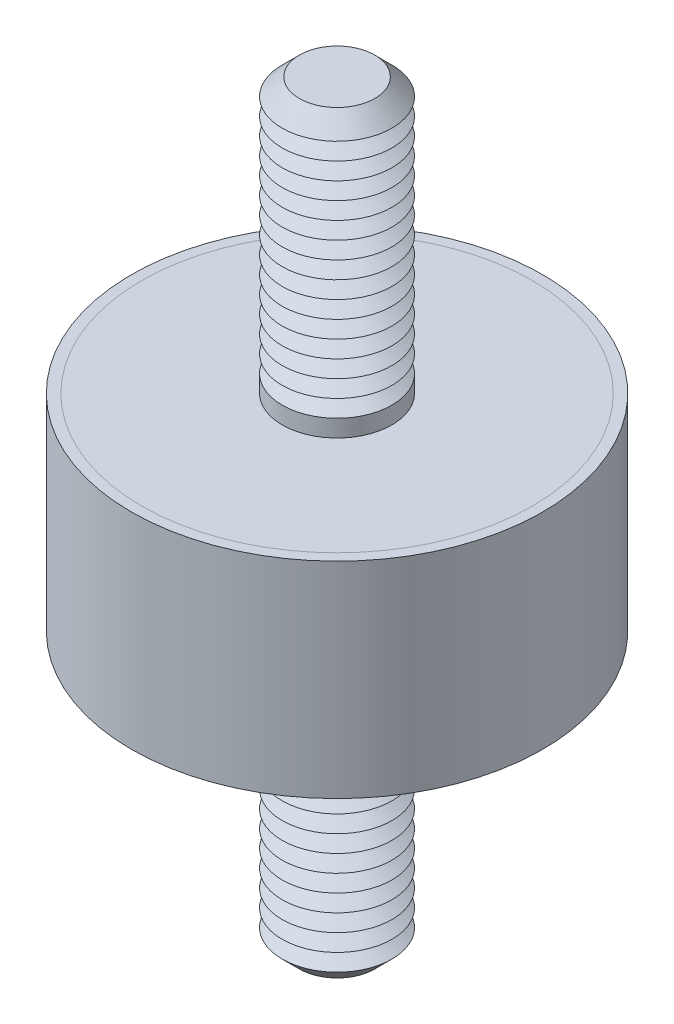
ISO-10303-21;
HEADER;
FILE_DESCRIPTION(('STEP AP214'),'2;1');
FILE_NAME('part.step','',(''),(''),'','','');
FILE_SCHEMA(('AUTOMOTIVE_DESIGN { 1 0 10303 214 1 1 1 1 }'));
ENDSEC;
DATA;
#1=APPLICATION_CONTEXT('core data for automotive mechanical design processes');
#2=APPLICATION_PROTOCOL_DEFINITION('international standard','automotive_design',2000,#1);
#3=PRODUCT_CONTEXT('',#1,'mechanical');
#4=PRODUCT('Part','Part','',(#3));
#5=PRODUCT_RELATED_PRODUCT_CATEGORY('part','',(#4));
#6=PRODUCT_DEFINITION_FORMATION('','',#4);
#7=PRODUCT_DEFINITION_CONTEXT('part definition',#1,'design');
#8=PRODUCT_DEFINITION('design','',#6,#7);
#9=PRODUCT_DEFINITION_SHAPE('','',#8);
#10=(LENGTH_UNIT() NAMED_UNIT(*) SI_UNIT(.MILLI.,.METRE.));
#11=(NAMED_UNIT(*) PLANE_ANGLE_UNIT() SI_UNIT($,.RADIAN.));
#12=(NAMED_UNIT(*) SI_UNIT($,.STERADIAN.) SOLID_ANGLE_UNIT());
#13=UNCERTAINTY_MEASURE_WITH_UNIT(LENGTH_MEASURE(1.E-05),#10,'distance_accuracy_value','');
#14=(GEOMETRIC_REPRESENTATION_CONTEXT(3) GLOBAL_UNCERTAINTY_ASSIGNED_CONTEXT((#13)) GLOBAL_UNIT_ASSIGNED_CONTEXT((#10,
#11,#12)) REPRESENTATION_CONTEXT('',''));
#15=CARTESIAN_POINT('',(0.,0.,0.));
#16=DIRECTION('',(0.,0.,1.));
#17=DIRECTION('',(1.,0.,0.));
#18=AXIS2_PLACEMENT_3D('',#15,#16,#17);
#19=CARTESIAN_POINT('',(0.,-27.5,0.));
#20=DIRECTION('',(0.,1.,0.));
#21=DIRECTION('',(0.,0.,1.));
#22=AXIS2_PLACEMENT_3D('',#19,#20,#21);
#23=CYLINDRICAL_SURFACE('',#22,4.);
#24=CARTESIAN_POINT('',(0.,-7.5,0.));
#25=DIRECTION('',(0.,-1.,0.));
#26=DIRECTION('',(0.,0.,-1.));
#27=AXIS2_PLACEMENT_3D('',#24,#25,#26);
#28=CIRCLE('',#27,4.);
#29=CARTESIAN_POINT('',(0.,-7.5,-4.));
#30=VERTEX_POINT('',#29);
#31=EDGE_CURVE('P0_E21',#30,#30,#28,.T.);
#32=ORIENTED_EDGE('',*,*,#31,.T.);
#33=EDGE_LOOP('',(#32));
#34=FACE_BOUND('',#33,.T.);
#35=CARTESIAN_POINT('',(0.,-8.75,0.));
#36=DIRECTION('',(0.,1.,0.));
#37=DIRECTION('',(0.,0.,1.));
#38=AXIS2_PLACEMENT_3D('',#35,#36,#37);
#39=CIRCLE('',#38,4.);
#40=CARTESIAN_POINT('',(0.,-8.75,4.));
#41=VERTEX_POINT('',#40);
#42=EDGE_CURVE('P0_E33',#41,#41,#39,.T.);
#43=ORIENTED_EDGE('',*,*,#42,.T.);
#44=EDGE_LOOP('',(#43));
#45=FACE_BOUND('',#44,.T.);
#46=ADVANCED_FACE('P0_F14',(#34,#45),#23,.T.);
#47=CARTESIAN_POINT('',(0.,-7.5,0.));
#48=DIRECTION('',(0.,1.,0.));
#49=DIRECTION('',(0.,0.,1.));
#50=AXIS2_PLACEMENT_3D('',#47,#48,#49);
#51=CYLINDRICAL_SURFACE('',#50,14.25);
#52=CARTESIAN_POINT('',(0.,-7.5,0.));
#53=DIRECTION('',(0.,1.,0.));
#54=DIRECTION('',(0.,0.,1.));
#55=AXIS2_PLACEMENT_3D('',#52,#53,#54);
#56=CIRCLE('',#55,14.25);
#57=CARTESIAN_POINT('',(0.,-7.5,14.25));
#58=VERTEX_POINT('',#57);
#59=EDGE_CURVE('P0_E25',#58,#58,#56,.T.);
#60=ORIENTED_EDGE('',*,*,#59,.T.);
#61=EDGE_LOOP('',(#60));
#62=FACE_BOUND('',#61,.T.);
#63=CARTESIAN_POINT('',(0.,-7.,0.));
#64=DIRECTION('',(0.,1.,0.));
#65=DIRECTION('',(0.,0.,1.));
#66=AXIS2_PLACEMENT_3D('',#63,#64,#65);
#67=CIRCLE('',#66,14.25);
#68=CARTESIAN_POINT('',(0.,-7.,14.25));
#69=VERTEX_POINT('',#68);
#70=EDGE_CURVE('P0_E30',#69,#69,#67,.T.);
#71=ORIENTED_EDGE('',*,*,#70,.F.);
#72=EDGE_LOOP('',(#71));
#73=FACE_BOUND('',#72,.T.);
#74=ADVANCED_FACE('P0_F145',(#62,#73),#51,.T.);
#75=CARTESIAN_POINT('',(0.,-7.5,0.));
#76=DIRECTION('',(0.,1.,0.));
#77=DIRECTION('',(0.,0.,1.));
#78=AXIS2_PLACEMENT_3D('',#75,#76,#77);
#79=PLANE('',#78);
#80=ORIENTED_EDGE('',*,*,#31,.F.);
#81=EDGE_LOOP('',(#80));
#82=FACE_BOUND('',#81,.T.);
#83=ORIENTED_EDGE('',*,*,#59,.F.);
#84=EDGE_LOOP('',(#83));
#85=FACE_BOUND('',#84,.T.);
#86=ADVANCED_FACE('P0_F150',(#82,#85),#79,.F.);
#87=CARTESIAN_POINT('',(0.,-7.,0.));
#88=DIRECTION('',(0.,1.,0.));
#89=DIRECTION('',(0.,0.,1.));
#90=AXIS2_PLACEMENT_3D('',#87,#88,#89);
#91=PLANE('',#90);
#92=ORIENTED_EDGE('',*,*,#70,.T.);
#93=EDGE_LOOP('',(#92));
#94=FACE_BOUND('',#93,.T.);
#95=ADVANCED_FACE('P0_F156',(#94),#91,.T.);
#96=CARTESIAN_POINT('',(0.,-8.75,0.));
#97=DIRECTION('',(0.,1.,0.));
#98=DIRECTION('',(0.,0.,1.));
#99=AXIS2_PLACEMENT_3D('',#96,#97,#98);
#100=CONICAL_SURFACE('',#99,4.,1.0471975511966);
#101=CARTESIAN_POINT('',(0.,-9.37499999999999,0.));
#102=DIRECTION('',(0.,1.,0.));
#103=DIRECTION('',(0.,0.,1.));
#104=AXIS2_PLACEMENT_3D('',#101,#102,#103);
#105=CIRCLE('',#104,2.91746824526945);
#106=CARTESIAN_POINT('',(0.,-9.37499999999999,2.91746824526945));
#107=VERTEX_POINT('',#106);
#108=EDGE_CURVE('P0_E39',#107,#107,#105,.T.);
#109=ORIENTED_EDGE('',*,*,#108,.T.);
#110=EDGE_LOOP('',(#109));
#111=FACE_BOUND('',#110,.T.);
#112=ORIENTED_EDGE('',*,*,#42,.F.);
#113=EDGE_LOOP('',(#112));
#114=FACE_BOUND('',#113,.T.);
#115=ADVANCED_FACE('P0_F159',(#111,#114),#100,.T.);
#116=CARTESIAN_POINT('',(0.,-9.37499999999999,0.));
#117=DIRECTION('',(0.,-1.,0.));
#118=DIRECTION('',(0.,0.,-1.));
#119=AXIS2_PLACEMENT_3D('',#116,#117,#118);
#120=CONICAL_SURFACE('',#119,2.91746824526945,1.04719755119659);
#121=CARTESIAN_POINT('',(0.,-10.,0.));
#122=DIRECTION('',(0.,1.,0.));
#123=DIRECTION('',(0.,0.,1.));
#124=AXIS2_PLACEMENT_3D('',#121,#122,#123);
#125=CIRCLE('',#124,4.);
#126=CARTESIAN_POINT('',(0.,-10.,4.));
#127=VERTEX_POINT('',#126);
#128=EDGE_CURVE('P0_E43',#127,#127,#125,.T.);
#129=ORIENTED_EDGE('',*,*,#128,.T.);
#130=EDGE_LOOP('',(#129));
#131=FACE_BOUND('',#130,.T.);
#132=ORIENTED_EDGE('',*,*,#108,.F.);
#133=EDGE_LOOP('',(#132));
#134=FACE_BOUND('',#133,.T.);
#135=ADVANCED_FACE('P0_F163',(#131,#134),#120,.T.);
#136=CARTESIAN_POINT('',(0.,-10.,0.));
#137=DIRECTION('',(0.,1.,0.));
#138=DIRECTION('',(0.,0.,1.));
#139=AXIS2_PLACEMENT_3D('',#136,#137,#138);
#140=CONICAL_SURFACE('',#139,4.,1.0471975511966);
#141=CARTESIAN_POINT('',(0.,-10.625,0.));
#142=DIRECTION('',(0.,1.,0.));
#143=DIRECTION('',(0.,0.,1.));
#144=AXIS2_PLACEMENT_3D('',#141,#142,#143);
#145=CIRCLE('',#144,2.91746824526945);
#146=CARTESIAN_POINT('',(0.,-10.625,2.91746824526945));
#147=VERTEX_POINT('',#146);
#148=EDGE_CURVE('P0_E47',#147,#147,#145,.T.);
#149=ORIENTED_EDGE('',*,*,#148,.T.);
#150=EDGE_LOOP('',(#149));
#151=FACE_BOUND('',#150,.T.);
#152=ORIENTED_EDGE('',*,*,#128,.F.);
#153=EDGE_LOOP('',(#152));
#154=FACE_BOUND('',#153,.T.);
#155=ADVANCED_FACE('P0_F167',(#151,#154),#140,.T.);
#156=CARTESIAN_POINT('',(0.,-10.625,0.));
#157=DIRECTION('',(0.,-1.,0.));
#158=DIRECTION('',(0.,0.,-1.));
#159=AXIS2_PLACEMENT_3D('',#156,#157,#158);
#160=CONICAL_SURFACE('',#159,2.91746824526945,1.04719755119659);
#161=CARTESIAN_POINT('',(0.,-11.25,0.));
#162=DIRECTION('',(0.,1.,0.));
#163=DIRECTION('',(0.,0.,1.));
#164=AXIS2_PLACEMENT_3D('',#161,#162,#163);
#165=CIRCLE('',#164,4.);
#166=CARTESIAN_POINT('',(0.,-11.25,4.));
#167=VERTEX_POINT('',#166);
#168=EDGE_CURVE('P0_E52',#167,#167,#165,.T.);
#169=ORIENTED_EDGE('',*,*,#168,.T.);
#170=EDGE_LOOP('',(#169));
#171=FACE_BOUND('',#170,.T.);
#172=ORIENTED_EDGE('',*,*,#148,.F.);
#173=EDGE_LOOP('',(#172));
#174=FACE_BOUND('',#173,.T.);
#175=ADVANCED_FACE('P0_F174',(#171,#174),#160,.T.);
#176=CARTESIAN_POINT('',(0.,-11.25,0.));
#177=DIRECTION('',(0.,1.,0.));
#178=DIRECTION('',(0.,0.,1.));
#179=AXIS2_PLACEMENT_3D('',#176,#177,#178);
#180=CONICAL_SURFACE('',#179,4.,1.0471975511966);
#181=CARTESIAN_POINT('',(0.,-11.875,0.));
#182=DIRECTION('',(0.,1.,0.));
#183=DIRECTION('',(0.,0.,1.));
#184=AXIS2_PLACEMENT_3D('',#181,#182,#183);
#185=CIRCLE('',#184,2.91746824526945);
#186=CARTESIAN_POINT('',(0.,-11.875,2.91746824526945));
#187=VERTEX_POINT('',#186);
#188=EDGE_CURVE('P0_E55',#187,#187,#185,.T.);
#189=ORIENTED_EDGE('',*,*,#188,.T.);
#190=EDGE_LOOP('',(#189));
#191=FACE_BOUND('',#190,.T.);
#192=ORIENTED_EDGE('',*,*,#168,.F.);
#193=EDGE_LOOP('',(#192));
#194=FACE_BOUND('',#193,.T.);
#195=ADVANCED_FACE('P0_F178',(#191,#194),#180,.T.);
#196=CARTESIAN_POINT('',(0.,-11.875,0.));
#197=DIRECTION('',(0.,-1.,0.));
#198=DIRECTION('',(0.,0.,-1.));
#199=AXIS2_PLACEMENT_3D('',#196,#197,#198);
#200=CONICAL_SURFACE('',#199,2.91746824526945,1.04719755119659);
#201=CARTESIAN_POINT('',(0.,-12.5,0.));
#202=DIRECTION('',(0.,1.,0.));
#203=DIRECTION('',(0.,0.,1.));
#204=AXIS2_PLACEMENT_3D('',#201,#202,#203);
#205=CIRCLE('',#204,4.);
#206=CARTESIAN_POINT('',(0.,-12.5,4.));
#207=VERTEX_POINT('',#206);
#208=EDGE_CURVE('P0_E58',#207,#207,#205,.T.);
#209=ORIENTED_EDGE('',*,*,#208,.T.);
#210=EDGE_LOOP('',(#209));
#211=FACE_BOUND('',#210,.T.);
#212=ORIENTED_EDGE('',*,*,#188,.F.);
#213=EDGE_LOOP('',(#212));
#214=FACE_BOUND('',#213,.T.);
#215=ADVANCED_FACE('P0_F182',(#211,#214),#200,.T.);
#216=CARTESIAN_POINT('',(0.,-12.5,0.));
#217=DIRECTION('',(0.,1.,0.));
#218=DIRECTION('',(0.,0.,1.));
#219=AXIS2_PLACEMENT_3D('',#216,#217,#218);
#220=CONICAL_SURFACE('',#219,4.,1.0471975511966);
#221=CARTESIAN_POINT('',(0.,-13.125,0.));
#222=DIRECTION('',(0.,1.,0.));
#223=DIRECTION('',(0.,0.,1.));
#224=AXIS2_PLACEMENT_3D('',#221,#222,#223);
#225=CIRCLE('',#224,2.91746824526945);
#226=CARTESIAN_POINT('',(0.,-13.125,2.91746824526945));
#227=VERTEX_POINT('',#226);
#228=EDGE_CURVE('P0_E61',#227,#227,#225,.T.);
#229=ORIENTED_EDGE('',*,*,#228,.T.);
#230=EDGE_LOOP('',(#229));
#231=FACE_BOUND('',#230,.T.);
#232=ORIENTED_EDGE('',*,*,#208,.F.);
#233=EDGE_LOOP('',(#232));
#234=FACE_BOUND('',#233,.T.);
#235=ADVANCED_FACE('P0_F186',(#231,#234),#220,.T.);
#236=CARTESIAN_POINT('',(0.,-13.125,0.));
#237=DIRECTION('',(0.,-1.,0.));
#238=DIRECTION('',(0.,0.,-1.));
#239=AXIS2_PLACEMENT_3D('',#236,#237,#238);
#240=CONICAL_SURFACE('',#239,2.91746824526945,1.04719755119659);
#241=CARTESIAN_POINT('',(0.,-13.75,0.));
#242=DIRECTION('',(0.,1.,0.));
#243=DIRECTION('',(0.,0.,1.));
#244=AXIS2_PLACEMENT_3D('',#241,#242,#243);
#245=CIRCLE('',#244,4.);
#246=CARTESIAN_POINT('',(0.,-13.75,4.));
#247=VERTEX_POINT('',#246);
#248=EDGE_CURVE('P0_E64',#247,#247,#245,.T.);
#249=ORIENTED_EDGE('',*,*,#248,.T.);
#250=EDGE_LOOP('',(#249));
#251=FACE_BOUND('',#250,.T.);
#252=ORIENTED_EDGE('',*,*,#228,.F.);
#253=EDGE_LOOP('',(#252));
#254=FACE_BOUND('',#253,.T.);
#255=ADVANCED_FACE('P0_F190',(#251,#254),#240,.T.);
#256=CARTESIAN_POINT('',(0.,-13.75,0.));
#257=DIRECTION('',(0.,1.,0.));
#258=DIRECTION('',(0.,0.,1.));
#259=AXIS2_PLACEMENT_3D('',#256,#257,#258);
#260=CONICAL_SURFACE('',#259,4.,1.0471975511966);
#261=CARTESIAN_POINT('',(0.,-14.375,0.));
#262=DIRECTION('',(0.,1.,0.));
#263=DIRECTION('',(0.,0.,1.));
#264=AXIS2_PLACEMENT_3D('',#261,#262,#263);
#265=CIRCLE('',#264,2.91746824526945);
#266=CARTESIAN_POINT('',(0.,-14.375,2.91746824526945));
#267=VERTEX_POINT('',#266);
#268=EDGE_CURVE('P0_E67',#267,#267,#265,.T.);
#269=ORIENTED_EDGE('',*,*,#268,.T.);
#270=EDGE_LOOP('',(#269));
#271=FACE_BOUND('',#270,.T.);
#272=ORIENTED_EDGE('',*,*,#248,.F.);
#273=EDGE_LOOP('',(#272));
#274=FACE_BOUND('',#273,.T.);
#275=ADVANCED_FACE('P0_F194',(#271,#274),#260,.T.);
#276=CARTESIAN_POINT('',(0.,-14.375,0.));
#277=DIRECTION('',(0.,-1.,0.));
#278=DIRECTION('',(0.,0.,-1.));
#279=AXIS2_PLACEMENT_3D('',#276,#277,#278);
#280=CONICAL_SURFACE('',#279,2.91746824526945,1.04719755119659);
#281=CARTESIAN_POINT('',(0.,-15.,0.));
#282=DIRECTION('',(0.,1.,0.));
#283=DIRECTION('',(0.,0.,1.));
#284=AXIS2_PLACEMENT_3D('',#281,#282,#283);
#285=CIRCLE('',#284,4.);
#286=CARTESIAN_POINT('',(0.,-15.,4.));
#287=VERTEX_POINT('',#286);
#288=EDGE_CURVE('P0_E70',#287,#287,#285,.T.);
#289=ORIENTED_EDGE('',*,*,#288,.T.);
#290=EDGE_LOOP('',(#289));
#291=FACE_BOUND('',#290,.T.);
#292=ORIENTED_EDGE('',*,*,#268,.F.);
#293=EDGE_LOOP('',(#292));
#294=FACE_BOUND('',#293,.T.);
#295=ADVANCED_FACE('P0_F198',(#291,#294),#280,.T.);
#296=CARTESIAN_POINT('',(0.,-15.,0.));
#297=DIRECTION('',(0.,1.,0.));
#298=DIRECTION('',(0.,0.,1.));
#299=AXIS2_PLACEMENT_3D('',#296,#297,#298);
#300=CONICAL_SURFACE('',#299,4.,1.0471975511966);
#301=CARTESIAN_POINT('',(0.,-15.625,0.));
#302=DIRECTION('',(0.,1.,0.));
#303=DIRECTION('',(0.,0.,1.));
#304=AXIS2_PLACEMENT_3D('',#301,#302,#303);
#305=CIRCLE('',#304,2.91746824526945);
#306=CARTESIAN_POINT('',(0.,-15.625,2.91746824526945));
#307=VERTEX_POINT('',#306);
#308=EDGE_CURVE('P0_E73',#307,#307,#305,.T.);
#309=ORIENTED_EDGE('',*,*,#308,.T.);
#310=EDGE_LOOP('',(#309));
#311=FACE_BOUND('',#310,.T.);
#312=ORIENTED_EDGE('',*,*,#288,.F.);
#313=EDGE_LOOP('',(#312));
#314=FACE_BOUND('',#313,.T.);
#315=ADVANCED_FACE('P0_F202',(#311,#314),#300,.T.);
#316=CARTESIAN_POINT('',(0.,-15.625,0.));
#317=DIRECTION('',(0.,-1.,0.));
#318=DIRECTION('',(0.,0.,-1.));
#319=AXIS2_PLACEMENT_3D('',#316,#317,#318);
#320=CONICAL_SURFACE('',#319,2.91746824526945,1.04719755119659);
#321=CARTESIAN_POINT('',(0.,-16.25,0.));
#322=DIRECTION('',(0.,1.,0.));
#323=DIRECTION('',(0.,0.,1.));
#324=AXIS2_PLACEMENT_3D('',#321,#322,#323);
#325=CIRCLE('',#324,4.);
#326=CARTESIAN_POINT('',(0.,-16.25,4.));
#327=VERTEX_POINT('',#326);
#328=EDGE_CURVE('P0_E76',#327,#327,#325,.T.);
#329=ORIENTED_EDGE('',*,*,#328,.T.);
#330=EDGE_LOOP('',(#329));
#331=FACE_BOUND('',#330,.T.);
#332=ORIENTED_EDGE('',*,*,#308,.F.);
#333=EDGE_LOOP('',(#332));
#334=FACE_BOUND('',#333,.T.);
#335=ADVANCED_FACE('P0_F206',(#331,#334),#320,.T.);
#336=CARTESIAN_POINT('',(0.,-16.25,0.));
#337=DIRECTION('',(0.,1.,0.));
#338=DIRECTION('',(0.,0.,1.));
#339=AXIS2_PLACEMENT_3D('',#336,#337,#338);
#340=CONICAL_SURFACE('',#339,4.,1.0471975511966);
#341=CARTESIAN_POINT('',(0.,-16.875,0.));
#342=DIRECTION('',(0.,1.,0.));
#343=DIRECTION('',(0.,0.,1.));
#344=AXIS2_PLACEMENT_3D('',#341,#342,#343);
#345=CIRCLE('',#344,2.91746824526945);
#346=CARTESIAN_POINT('',(0.,-16.875,2.91746824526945));
#347=VERTEX_POINT('',#346);
#348=EDGE_CURVE('P0_E79',#347,#347,#345,.T.);
#349=ORIENTED_EDGE('',*,*,#348,.T.);
#350=EDGE_LOOP('',(#349));
#351=FACE_BOUND('',#350,.T.);
#352=ORIENTED_EDGE('',*,*,#328,.F.);
#353=EDGE_LOOP('',(#352));
#354=FACE_BOUND('',#353,.T.);
#355=ADVANCED_FACE('P0_F210',(#351,#354),#340,.T.);
#356=CARTESIAN_POINT('',(0.,-16.875,0.));
#357=DIRECTION('',(0.,-1.,0.));
#358=DIRECTION('',(0.,0.,-1.));
#359=AXIS2_PLACEMENT_3D('',#356,#357,#358);
#360=CONICAL_SURFACE('',#359,2.91746824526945,1.04719755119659);
#361=CARTESIAN_POINT('',(0.,-17.5,0.));
#362=DIRECTION('',(0.,1.,0.));
#363=DIRECTION('',(0.,0.,1.));
#364=AXIS2_PLACEMENT_3D('',#361,#362,#363);
#365=CIRCLE('',#364,4.);
#366=CARTESIAN_POINT('',(0.,-17.5,4.));
#367=VERTEX_POINT('',#366);
#368=EDGE_CURVE('P0_E82',#367,#367,#365,.T.);
#369=ORIENTED_EDGE('',*,*,#368,.T.);
#370=EDGE_LOOP('',(#369));
#371=FACE_BOUND('',#370,.T.);
#372=ORIENTED_EDGE('',*,*,#348,.F.);
#373=EDGE_LOOP('',(#372));
#374=FACE_BOUND('',#373,.T.);
#375=ADVANCED_FACE('P0_F214',(#371,#374),#360,.T.);
#376=CARTESIAN_POINT('',(0.,-17.5,0.));
#377=DIRECTION('',(0.,1.,0.));
#378=DIRECTION('',(0.,0.,1.));
#379=AXIS2_PLACEMENT_3D('',#376,#377,#378);
#380=CONICAL_SURFACE('',#379,4.,1.0471975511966);
#381=CARTESIAN_POINT('',(0.,-18.125,0.));
#382=DIRECTION('',(0.,1.,0.));
#383=DIRECTION('',(0.,0.,1.));
#384=AXIS2_PLACEMENT_3D('',#381,#382,#383);
#385=CIRCLE('',#384,2.91746824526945);
#386=CARTESIAN_POINT('',(0.,-18.125,2.91746824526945));
#387=VERTEX_POINT('',#386);
#388=EDGE_CURVE('P0_E85',#387,#387,#385,.T.);
#389=ORIENTED_EDGE('',*,*,#388,.T.);
#390=EDGE_LOOP('',(#389));
#391=FACE_BOUND('',#390,.T.);
#392=ORIENTED_EDGE('',*,*,#368,.F.);
#393=EDGE_LOOP('',(#392));
#394=FACE_BOUND('',#393,.T.);
#395=ADVANCED_FACE('P0_F218',(#391,#394),#380,.T.);
#396=CARTESIAN_POINT('',(0.,-18.125,0.));
#397=DIRECTION('',(0.,-1.,0.));
#398=DIRECTION('',(0.,0.,-1.));
#399=AXIS2_PLACEMENT_3D('',#396,#397,#398);
#400=CONICAL_SURFACE('',#399,2.91746824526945,1.04719755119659);
#401=CARTESIAN_POINT('',(0.,-18.75,0.));
#402=DIRECTION('',(0.,1.,0.));
#403=DIRECTION('',(0.,0.,1.));
#404=AXIS2_PLACEMENT_3D('',#401,#402,#403);
#405=CIRCLE('',#404,4.);
#406=CARTESIAN_POINT('',(0.,-18.75,4.));
#407=VERTEX_POINT('',#406);
#408=EDGE_CURVE('P0_E88',#407,#407,#405,.T.);
#409=ORIENTED_EDGE('',*,*,#408,.T.);
#410=EDGE_LOOP('',(#409));
#411=FACE_BOUND('',#410,.T.);
#412=ORIENTED_EDGE('',*,*,#388,.F.);
#413=EDGE_LOOP('',(#412));
#414=FACE_BOUND('',#413,.T.);
#415=ADVANCED_FACE('P0_F222',(#411,#414),#400,.T.);
#416=CARTESIAN_POINT('',(0.,-18.75,0.));
#417=DIRECTION('',(0.,1.,0.));
#418=DIRECTION('',(0.,0.,1.));
#419=AXIS2_PLACEMENT_3D('',#416,#417,#418);
#420=CONICAL_SURFACE('',#419,4.,1.0471975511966);
#421=CARTESIAN_POINT('',(0.,-19.375,0.));
#422=DIRECTION('',(0.,1.,0.));
#423=DIRECTION('',(0.,0.,1.));
#424=AXIS2_PLACEMENT_3D('',#421,#422,#423);
#425=CIRCLE('',#424,2.91746824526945);
#426=CARTESIAN_POINT('',(0.,-19.375,2.91746824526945));
#427=VERTEX_POINT('',#426);
#428=EDGE_CURVE('P0_E91',#427,#427,#425,.T.);
#429=ORIENTED_EDGE('',*,*,#428,.T.);
#430=EDGE_LOOP('',(#429));
#431=FACE_BOUND('',#430,.T.);
#432=ORIENTED_EDGE('',*,*,#408,.F.);
#433=EDGE_LOOP('',(#432));
#434=FACE_BOUND('',#433,.T.);
#435=ADVANCED_FACE('P0_F226',(#431,#434),#420,.T.);
#436=CARTESIAN_POINT('',(0.,-19.375,0.));
#437=DIRECTION('',(0.,-1.,0.));
#438=DIRECTION('',(0.,0.,-1.));
#439=AXIS2_PLACEMENT_3D('',#436,#437,#438);
#440=CONICAL_SURFACE('',#439,2.91746824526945,1.04719755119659);
#441=CARTESIAN_POINT('',(0.,-20.,0.));
#442=DIRECTION('',(0.,1.,0.));
#443=DIRECTION('',(0.,0.,1.));
#444=AXIS2_PLACEMENT_3D('',#441,#442,#443);
#445=CIRCLE('',#444,4.);
#446=CARTESIAN_POINT('',(0.,-20.,4.));
#447=VERTEX_POINT('',#446);
#448=EDGE_CURVE('P0_E94',#447,#447,#445,.T.);
#449=ORIENTED_EDGE('',*,*,#448,.T.);
#450=EDGE_LOOP('',(#449));
#451=FACE_BOUND('',#450,.T.);
#452=ORIENTED_EDGE('',*,*,#428,.F.);
#453=EDGE_LOOP('',(#452));
#454=FACE_BOUND('',#453,.T.);
#455=ADVANCED_FACE('P0_F230',(#451,#454),#440,.T.);
#456=CARTESIAN_POINT('',(0.,-20.,0.));
#457=DIRECTION('',(0.,1.,0.));
#458=DIRECTION('',(0.,0.,1.));
#459=AXIS2_PLACEMENT_3D('',#456,#457,#458);
#460=CONICAL_SURFACE('',#459,4.,1.0471975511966);
#461=CARTESIAN_POINT('',(0.,-20.625,0.));
#462=DIRECTION('',(0.,1.,0.));
#463=DIRECTION('',(0.,0.,1.));
#464=AXIS2_PLACEMENT_3D('',#461,#462,#463);
#465=CIRCLE('',#464,2.91746824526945);
#466=CARTESIAN_POINT('',(0.,-20.625,2.91746824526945));
#467=VERTEX_POINT('',#466);
#468=EDGE_CURVE('P0_E97',#467,#467,#465,.T.);
#469=ORIENTED_EDGE('',*,*,#468,.T.);
#470=EDGE_LOOP('',(#469));
#471=FACE_BOUND('',#470,.T.);
#472=ORIENTED_EDGE('',*,*,#448,.F.);
#473=EDGE_LOOP('',(#472));
#474=FACE_BOUND('',#473,.T.);
#475=ADVANCED_FACE('P0_F234',(#471,#474),#460,.T.);
#476=CARTESIAN_POINT('',(0.,-20.625,0.));
#477=DIRECTION('',(0.,-1.,0.));
#478=DIRECTION('',(0.,0.,-1.));
#479=AXIS2_PLACEMENT_3D('',#476,#477,#478);
#480=CONICAL_SURFACE('',#479,2.91746824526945,1.04719755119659);
#481=CARTESIAN_POINT('',(0.,-21.25,0.));
#482=DIRECTION('',(0.,1.,0.));
#483=DIRECTION('',(0.,0.,1.));
#484=AXIS2_PLACEMENT_3D('',#481,#482,#483);
#485=CIRCLE('',#484,4.);
#486=CARTESIAN_POINT('',(0.,-21.25,4.));
#487=VERTEX_POINT('',#486);
#488=EDGE_CURVE('P0_E100',#487,#487,#485,.T.);
#489=ORIENTED_EDGE('',*,*,#488,.T.);
#490=EDGE_LOOP('',(#489));
#491=FACE_BOUND('',#490,.T.);
#492=ORIENTED_EDGE('',*,*,#468,.F.);
#493=EDGE_LOOP('',(#492));
#494=FACE_BOUND('',#493,.T.);
#495=ADVANCED_FACE('P0_F238',(#491,#494),#480,.T.);
#496=CARTESIAN_POINT('',(0.,-21.25,0.));
#497=DIRECTION('',(0.,1.,0.));
#498=DIRECTION('',(0.,0.,1.));
#499=AXIS2_PLACEMENT_3D('',#496,#497,#498);
#500=CONICAL_SURFACE('',#499,4.,1.0471975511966);
#501=CARTESIAN_POINT('',(0.,-21.875,0.));
#502=DIRECTION('',(0.,1.,0.));
#503=DIRECTION('',(0.,0.,1.));
#504=AXIS2_PLACEMENT_3D('',#501,#502,#503);
#505=CIRCLE('',#504,2.91746824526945);
#506=CARTESIAN_POINT('',(0.,-21.875,2.91746824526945));
#507=VERTEX_POINT('',#506);
#508=EDGE_CURVE('P0_E103',#507,#507,#505,.T.);
#509=ORIENTED_EDGE('',*,*,#508,.T.);
#510=EDGE_LOOP('',(#509));
#511=FACE_BOUND('',#510,.T.);
#512=ORIENTED_EDGE('',*,*,#488,.F.);
#513=EDGE_LOOP('',(#512));
#514=FACE_BOUND('',#513,.T.);
#515=ADVANCED_FACE('P0_F242',(#511,#514),#500,.T.);
#516=CARTESIAN_POINT('',(0.,-21.875,0.));
#517=DIRECTION('',(0.,-1.,0.));
#518=DIRECTION('',(0.,0.,-1.));
#519=AXIS2_PLACEMENT_3D('',#516,#517,#518);
#520=CONICAL_SURFACE('',#519,2.91746824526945,1.04719755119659);
#521=CARTESIAN_POINT('',(0.,-22.5,0.));
#522=DIRECTION('',(0.,1.,0.));
#523=DIRECTION('',(0.,0.,1.));
#524=AXIS2_PLACEMENT_3D('',#521,#522,#523);
#525=CIRCLE('',#524,4.);
#526=CARTESIAN_POINT('',(0.,-22.5,4.));
#527=VERTEX_POINT('',#526);
#528=EDGE_CURVE('P0_E106',#527,#527,#525,.T.);
#529=ORIENTED_EDGE('',*,*,#528,.T.);
#530=EDGE_LOOP('',(#529));
#531=FACE_BOUND('',#530,.T.);
#532=ORIENTED_EDGE('',*,*,#508,.F.);
#533=EDGE_LOOP('',(#532));
#534=FACE_BOUND('',#533,.T.);
#535=ADVANCED_FACE('P0_F246',(#531,#534),#520,.T.);
#536=CARTESIAN_POINT('',(0.,-22.5,0.));
#537=DIRECTION('',(0.,1.,0.));
#538=DIRECTION('',(0.,0.,1.));
#539=AXIS2_PLACEMENT_3D('',#536,#537,#538);
#540=CONICAL_SURFACE('',#539,4.,1.0471975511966);
#541=CARTESIAN_POINT('',(0.,-23.125,0.));
#542=DIRECTION('',(0.,1.,0.));
#543=DIRECTION('',(0.,0.,1.));
#544=AXIS2_PLACEMENT_3D('',#541,#542,#543);
#545=CIRCLE('',#544,2.91746824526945);
#546=CARTESIAN_POINT('',(0.,-23.125,2.91746824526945));
#547=VERTEX_POINT('',#546);
#548=EDGE_CURVE('P0_E109',#547,#547,#545,.T.);
#549=ORIENTED_EDGE('',*,*,#548,.T.);
#550=EDGE_LOOP('',(#549));
#551=FACE_BOUND('',#550,.T.);
#552=ORIENTED_EDGE('',*,*,#528,.F.);
#553=EDGE_LOOP('',(#552));
#554=FACE_BOUND('',#553,.T.);
#555=ADVANCED_FACE('P0_F250',(#551,#554),#540,.T.);
#556=CARTESIAN_POINT('',(0.,-23.125,0.));
#557=DIRECTION('',(0.,-1.,0.));
#558=DIRECTION('',(0.,0.,-1.));
#559=AXIS2_PLACEMENT_3D('',#556,#557,#558);
#560=CONICAL_SURFACE('',#559,2.91746824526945,1.04719755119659);
#561=CARTESIAN_POINT('',(0.,-23.75,0.));
#562=DIRECTION('',(0.,1.,0.));
#563=DIRECTION('',(0.,0.,1.));
#564=AXIS2_PLACEMENT_3D('',#561,#562,#563);
#565=CIRCLE('',#564,4.);
#566=CARTESIAN_POINT('',(0.,-23.75,4.));
#567=VERTEX_POINT('',#566);
#568=EDGE_CURVE('P0_E112',#567,#567,#565,.T.);
#569=ORIENTED_EDGE('',*,*,#568,.T.);
#570=EDGE_LOOP('',(#569));
#571=FACE_BOUND('',#570,.T.);
#572=ORIENTED_EDGE('',*,*,#548,.F.);
#573=EDGE_LOOP('',(#572));
#574=FACE_BOUND('',#573,.T.);
#575=ADVANCED_FACE('P0_F254',(#571,#574),#560,.T.);
#576=CARTESIAN_POINT('',(0.,-23.75,0.));
#577=DIRECTION('',(0.,1.,0.));
#578=DIRECTION('',(0.,0.,1.));
#579=AXIS2_PLACEMENT_3D('',#576,#577,#578);
#580=CONICAL_SURFACE('',#579,4.,1.0471975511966);
#581=CARTESIAN_POINT('',(0.,-24.375,0.));
#582=DIRECTION('',(0.,1.,0.));
#583=DIRECTION('',(0.,0.,1.));
#584=AXIS2_PLACEMENT_3D('',#581,#582,#583);
#585=CIRCLE('',#584,2.91746824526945);
#586=CARTESIAN_POINT('',(0.,-24.375,2.91746824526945));
#587=VERTEX_POINT('',#586);
#588=EDGE_CURVE('P0_E115',#587,#587,#585,.T.);
#589=ORIENTED_EDGE('',*,*,#588,.T.);
#590=EDGE_LOOP('',(#589));
#591=FACE_BOUND('',#590,.T.);
#592=ORIENTED_EDGE('',*,*,#568,.F.);
#593=EDGE_LOOP('',(#592));
#594=FACE_BOUND('',#593,.T.);
#595=ADVANCED_FACE('P0_F258',(#591,#594),#580,.T.);
#596=CARTESIAN_POINT('',(0.,-24.375,0.));
#597=DIRECTION('',(0.,-1.,0.));
#598=DIRECTION('',(0.,0.,-1.));
#599=AXIS2_PLACEMENT_3D('',#596,#597,#598);
#600=CONICAL_SURFACE('',#599,2.91746824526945,1.04719755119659);
#601=CARTESIAN_POINT('',(0.,-25.,0.));
#602=DIRECTION('',(0.,1.,0.));
#603=DIRECTION('',(0.,0.,1.));
#604=AXIS2_PLACEMENT_3D('',#601,#602,#603);
#605=CIRCLE('',#604,4.);
#606=CARTESIAN_POINT('',(0.,-25.,4.));
#607=VERTEX_POINT('',#606);
#608=EDGE_CURVE('P0_E118',#607,#607,#605,.T.);
#609=ORIENTED_EDGE('',*,*,#608,.T.);
#610=EDGE_LOOP('',(#609));
#611=FACE_BOUND('',#610,.T.);
#612=ORIENTED_EDGE('',*,*,#588,.F.);
#613=EDGE_LOOP('',(#612));
#614=FACE_BOUND('',#613,.T.);
#615=ADVANCED_FACE('P0_F142',(#611,#614),#600,.T.);
#616=CARTESIAN_POINT('',(0.,-25.,0.));
#617=DIRECTION('',(0.,1.,0.));
#618=DIRECTION('',(0.,0.,1.));
#619=AXIS2_PLACEMENT_3D('',#616,#617,#618);
#620=CONICAL_SURFACE('',#619,4.,1.0471975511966);
#621=CARTESIAN_POINT('',(0.,-25.625,0.));
#622=DIRECTION('',(0.,1.,0.));
#623=DIRECTION('',(0.,0.,1.));
#624=AXIS2_PLACEMENT_3D('',#621,#622,#623);
#625=CIRCLE('',#624,2.91746824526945);
#626=CARTESIAN_POINT('',(0.,-25.625,2.91746824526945));
#627=VERTEX_POINT('',#626);
#628=EDGE_CURVE('P0_E124',#627,#627,#625,.T.);
#629=ORIENTED_EDGE('',*,*,#628,.T.);
#630=EDGE_LOOP('',(#629));
#631=FACE_BOUND('',#630,.T.);
#632=ORIENTED_EDGE('',*,*,#608,.F.);
#633=EDGE_LOOP('',(#632));
#634=FACE_BOUND('',#633,.T.);
#635=ADVANCED_FACE('P0_F128',(#631,#634),#620,.T.);
#636=CARTESIAN_POINT('',(0.,-25.625,0.));
#637=DIRECTION('',(0.,-1.,0.));
#638=DIRECTION('',(0.,0.,-1.));
#639=AXIS2_PLACEMENT_3D('',#636,#637,#638);
#640=CONICAL_SURFACE('',#639,2.91746824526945,1.04719755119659);
#641=CARTESIAN_POINT('',(0.,-26.25,0.));
#642=DIRECTION('',(0.,1.,0.));
#643=DIRECTION('',(0.,0.,1.));
#644=AXIS2_PLACEMENT_3D('',#641,#642,#643);
#645=CIRCLE('',#644,4.);
#646=CARTESIAN_POINT('',(0.,-26.25,4.));
#647=VERTEX_POINT('',#646);
#648=EDGE_CURVE('P0_E121',#647,#647,#645,.T.);
#649=ORIENTED_EDGE('',*,*,#648,.T.);
#650=EDGE_LOOP('',(#649));
#651=FACE_BOUND('',#650,.T.);
#652=ORIENTED_EDGE('',*,*,#628,.F.);
#653=EDGE_LOOP('',(#652));
#654=FACE_BOUND('',#653,.T.);
#655=ADVANCED_FACE('P0_F131',(#651,#654),#640,.T.);
#656=CARTESIAN_POINT('',(0.,-27.5,0.));
#657=DIRECTION('',(0.,-1.,0.));
#658=DIRECTION('',(0.,0.,-1.));
#659=AXIS2_PLACEMENT_3D('',#656,#657,#658);
#660=PLANE('',#659);
#661=CARTESIAN_POINT('',(0.,-27.5,0.));
#662=DIRECTION('',(0.,-1.,0.));
#663=DIRECTION('',(0.,0.,-1.));
#664=AXIS2_PLACEMENT_3D('',#661,#662,#663);
#665=CIRCLE('',#664,2.75);
#666=CARTESIAN_POINT('',(0.,-27.5,-2.75));
#667=VERTEX_POINT('',#666);
#668=EDGE_CURVE('P0_E10',#667,#667,#665,.T.);
#669=ORIENTED_EDGE('',*,*,#668,.T.);
#670=EDGE_LOOP('',(#669));
#671=FACE_BOUND('',#670,.T.);
#672=ADVANCED_FACE('P0_F133',(#671),#660,.T.);
#673=CARTESIAN_POINT('',(0.,-27.5,0.));
#674=DIRECTION('',(0.,1.,0.));
#675=DIRECTION('',(0.,0.,1.));
#676=AXIS2_PLACEMENT_3D('',#673,#674,#675);
#677=CONICAL_SURFACE('',#676,2.75,0.785398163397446);
#678=ORIENTED_EDGE('',*,*,#648,.F.);
#679=EDGE_LOOP('',(#678));
#680=FACE_BOUND('',#679,.T.);
#681=ORIENTED_EDGE('',*,*,#668,.F.);
#682=EDGE_LOOP('',(#681));
#683=FACE_BOUND('',#682,.T.);
#684=ADVANCED_FACE('P0_F16',(#680,#683),#677,.T.);
#685=CLOSED_SHELL('',(#46,#74,#86,#95,#115,#135,#155,#175,#195,#215,#235,#255,#275,#295,#315,
#335,#355,#375,#395,#415,#435,#455,#475,#495,#515,#535,#555,#575,#595,#615,#635,#655,#672,#684));
#686=MANIFOLD_SOLID_BREP('P0_B1',#685);
#687=CARTESIAN_POINT('',(0.,27.5,0.));
#688=DIRECTION('',(0.,-1.,0.));
#689=DIRECTION('',(0.,0.,-1.));
#690=AXIS2_PLACEMENT_3D('',#687,#688,#689);
#691=CYLINDRICAL_SURFACE('',#690,4.);
#692=CARTESIAN_POINT('',(0.,8.75,0.));
#693=DIRECTION('',(0.,1.,0.));
#694=DIRECTION('',(0.,0.,1.));
#695=AXIS2_PLACEMENT_3D('',#692,#693,#694);
#696=CIRCLE('',#695,4.);
#697=CARTESIAN_POINT('',(0.,8.75,4.));
#698=VERTEX_POINT('',#697);
#699=EDGE_CURVE('P1_E33',#698,#698,#696,.T.);
#700=ORIENTED_EDGE('',*,*,#699,.F.);
#701=EDGE_LOOP('',(#700));
#702=FACE_BOUND('',#701,.T.);
#703=CARTESIAN_POINT('',(0.,7.5,0.));
#704=DIRECTION('',(0.,1.,0.));
#705=DIRECTION('',(0.,0.,1.));
#706=AXIS2_PLACEMENT_3D('',#703,#704,#705);
#707=CIRCLE('',#706,4.);
#708=CARTESIAN_POINT('',(0.,7.5,4.));
#709=VERTEX_POINT('',#708);
#710=EDGE_CURVE('P1_E21',#709,#709,#707,.T.);
#711=ORIENTED_EDGE('',*,*,#710,.T.);
#712=EDGE_LOOP('',(#711));
#713=FACE_BOUND('',#712,.T.);
#714=ADVANCED_FACE('P1_F14',(#702,#713),#691,.T.);
#715=CARTESIAN_POINT('',(0.,7.5,0.));
#716=DIRECTION('',(0.,-1.,0.));
#717=DIRECTION('',(0.,0.,-1.));
#718=AXIS2_PLACEMENT_3D('',#715,#716,#717);
#719=CYLINDRICAL_SURFACE('',#718,14.25);
#720=CARTESIAN_POINT('',(0.,7.5,0.));
#721=DIRECTION('',(0.,1.,0.));
#722=DIRECTION('',(0.,0.,1.));
#723=AXIS2_PLACEMENT_3D('',#720,#721,#722);
#724=CIRCLE('',#723,14.25);
#725=CARTESIAN_POINT('',(0.,7.5,14.25));
#726=VERTEX_POINT('',#725);
#727=EDGE_CURVE('P1_E25',#726,#726,#724,.T.);
#728=ORIENTED_EDGE('',*,*,#727,.F.);
#729=EDGE_LOOP('',(#728));
#730=FACE_BOUND('',#729,.T.);
#731=CARTESIAN_POINT('',(0.,7.,0.));
#732=DIRECTION('',(0.,1.,0.));
#733=DIRECTION('',(0.,0.,1.));
#734=AXIS2_PLACEMENT_3D('',#731,#732,#733);
#735=CIRCLE('',#734,14.25);
#736=CARTESIAN_POINT('',(0.,7.,14.25));
#737=VERTEX_POINT('',#736);
#738=EDGE_CURVE('P1_E30',#737,#737,#735,.T.);
#739=ORIENTED_EDGE('',*,*,#738,.T.);
#740=EDGE_LOOP('',(#739));
#741=FACE_BOUND('',#740,.T.);
#742=ADVANCED_FACE('P1_F292',(#730,#741),#719,.T.);
#743=CARTESIAN_POINT('',(0.,7.5,0.));
#744=DIRECTION('',(0.,1.,0.));
#745=DIRECTION('',(0.,0.,1.));
#746=AXIS2_PLACEMENT_3D('',#743,#744,#745);
#747=PLANE('',#746);
#748=ORIENTED_EDGE('',*,*,#710,.F.);
#749=EDGE_LOOP('',(#748));
#750=FACE_BOUND('',#749,.T.);
#751=ORIENTED_EDGE('',*,*,#727,.T.);
#752=EDGE_LOOP('',(#751));
#753=FACE_BOUND('',#752,.T.);
#754=ADVANCED_FACE('P1_F298',(#750,#753),#747,.T.);
#755=CARTESIAN_POINT('',(0.,7.,0.));
#756=DIRECTION('',(0.,1.,0.));
#757=DIRECTION('',(0.,0.,1.));
#758=AXIS2_PLACEMENT_3D('',#755,#756,#757);
#759=PLANE('',#758);
#760=ORIENTED_EDGE('',*,*,#738,.F.);
#761=EDGE_LOOP('',(#760));
#762=FACE_BOUND('',#761,.T.);
#763=ADVANCED_FACE('P1_F288',(#762),#759,.F.);
#764=CARTESIAN_POINT('',(0.,8.75,0.));
#765=DIRECTION('',(0.,-1.,0.));
#766=DIRECTION('',(0.,0.,-1.));
#767=AXIS2_PLACEMENT_3D('',#764,#765,#766);
#768=CONICAL_SURFACE('',#767,4.,1.0471975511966);
#769=CARTESIAN_POINT('',(0.,9.375,0.));
#770=DIRECTION('',(0.,1.,0.));
#771=DIRECTION('',(0.,0.,1.));
#772=AXIS2_PLACEMENT_3D('',#769,#770,#771);
#773=CIRCLE('',#772,2.91746824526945);
#774=CARTESIAN_POINT('',(0.,9.375,2.91746824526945));
#775=VERTEX_POINT('',#774);
#776=EDGE_CURVE('P1_E39',#775,#775,#773,.T.);
#777=ORIENTED_EDGE('',*,*,#776,.F.);
#778=EDGE_LOOP('',(#777));
#779=FACE_BOUND('',#778,.T.);
#780=ORIENTED_EDGE('',*,*,#699,.T.);
#781=EDGE_LOOP('',(#780));
#782=FACE_BOUND('',#781,.T.);
#783=ADVANCED_FACE('P1_F282',(#779,#782),#768,.T.);
#784=CARTESIAN_POINT('',(0.,9.375,0.));
#785=DIRECTION('',(0.,1.,0.));
#786=DIRECTION('',(0.,0.,1.));
#787=AXIS2_PLACEMENT_3D('',#784,#785,#786);
#788=CONICAL_SURFACE('',#787,2.91746824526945,1.04719755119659);
#789=CARTESIAN_POINT('',(0.,10.,0.));
#790=DIRECTION('',(0.,1.,0.));
#791=DIRECTION('',(0.,0.,1.));
#792=AXIS2_PLACEMENT_3D('',#789,#790,#791);
#793=CIRCLE('',#792,4.);
#794=CARTESIAN_POINT('',(0.,10.,4.));
#795=VERTEX_POINT('',#794);
#796=EDGE_CURVE('P1_E43',#795,#795,#793,.T.);
#797=ORIENTED_EDGE('',*,*,#796,.F.);
#798=EDGE_LOOP('',(#797));
#799=FACE_BOUND('',#798,.T.);
#800=ORIENTED_EDGE('',*,*,#776,.T.);
#801=EDGE_LOOP('',(#800));
#802=FACE_BOUND('',#801,.T.);
#803=ADVANCED_FACE('P1_F277',(#799,#802),#788,.T.);
#804=CARTESIAN_POINT('',(0.,10.,0.));
#805=DIRECTION('',(0.,-1.,0.));
#806=DIRECTION('',(0.,0.,-1.));
#807=AXIS2_PLACEMENT_3D('',#804,#805,#806);
#808=CONICAL_SURFACE('',#807,4.,1.0471975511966);
#809=CARTESIAN_POINT('',(0.,10.625,0.));
#810=DIRECTION('',(0.,1.,0.));
#811=DIRECTION('',(0.,0.,1.));
#812=AXIS2_PLACEMENT_3D('',#809,#810,#811);
#813=CIRCLE('',#812,2.91746824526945);
#814=CARTESIAN_POINT('',(0.,10.625,2.91746824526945));
#815=VERTEX_POINT('',#814);
#816=EDGE_CURVE('P1_E47',#815,#815,#813,.T.);
#817=ORIENTED_EDGE('',*,*,#816,.F.);
#818=EDGE_LOOP('',(#817));
#819=FACE_BOUND('',#818,.T.);
#820=ORIENTED_EDGE('',*,*,#796,.T.);
#821=EDGE_LOOP('',(#820));
#822=FACE_BOUND('',#821,.T.);
#823=ADVANCED_FACE('P1_F271',(#819,#822),#808,.T.);
#824=CARTESIAN_POINT('',(0.,10.625,0.));
#825=DIRECTION('',(0.,1.,0.));
#826=DIRECTION('',(0.,0.,1.));
#827=AXIS2_PLACEMENT_3D('',#824,#825,#826);
#828=CONICAL_SURFACE('',#827,2.91746824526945,1.04719755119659);
#829=CARTESIAN_POINT('',(0.,11.25,0.));
#830=DIRECTION('',(0.,1.,0.));
#831=DIRECTION('',(0.,0.,1.));
#832=AXIS2_PLACEMENT_3D('',#829,#830,#831);
#833=CIRCLE('',#832,4.);
#834=CARTESIAN_POINT('',(0.,11.25,4.));
#835=VERTEX_POINT('',#834);
#836=EDGE_CURVE('P1_E52',#835,#835,#833,.T.);
#837=ORIENTED_EDGE('',*,*,#836,.F.);
#838=EDGE_LOOP('',(#837));
#839=FACE_BOUND('',#838,.T.);
#840=ORIENTED_EDGE('',*,*,#816,.T.);
#841=EDGE_LOOP('',(#840));
#842=FACE_BOUND('',#841,.T.);
#843=ADVANCED_FACE('P1_F265',(#839,#842),#828,.T.);
#844=CARTESIAN_POINT('',(0.,11.25,0.));
#845=DIRECTION('',(0.,-1.,0.));
#846=DIRECTION('',(0.,0.,-1.));
#847=AXIS2_PLACEMENT_3D('',#844,#845,#846);
#848=CONICAL_SURFACE('',#847,4.,1.0471975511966);
#849=CARTESIAN_POINT('',(0.,11.875,0.));
#850=DIRECTION('',(0.,1.,0.));
#851=DIRECTION('',(0.,0.,1.));
#852=AXIS2_PLACEMENT_3D('',#849,#850,#851);
#853=CIRCLE('',#852,2.91746824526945);
#854=CARTESIAN_POINT('',(0.,11.875,2.91746824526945));
#855=VERTEX_POINT('',#854);
#856=EDGE_CURVE('P1_E55',#855,#855,#853,.T.);
#857=ORIENTED_EDGE('',*,*,#856,.F.);
#858=EDGE_LOOP('',(#857));
#859=FACE_BOUND('',#858,.T.);
#860=ORIENTED_EDGE('',*,*,#836,.T.);
#861=EDGE_LOOP('',(#860));
#862=FACE_BOUND('',#861,.T.);
#863=ADVANCED_FACE('P1_F259',(#859,#862),#848,.T.);
#864=CARTESIAN_POINT('',(0.,11.875,0.));
#865=DIRECTION('',(0.,1.,0.));
#866=DIRECTION('',(0.,0.,1.));
#867=AXIS2_PLACEMENT_3D('',#864,#865,#866);
#868=CONICAL_SURFACE('',#867,2.91746824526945,1.04719755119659);
#869=CARTESIAN_POINT('',(0.,12.5,0.));
#870=DIRECTION('',(0.,1.,0.));
#871=DIRECTION('',(0.,0.,1.));
#872=AXIS2_PLACEMENT_3D('',#869,#870,#871);
#873=CIRCLE('',#872,4.);
#874=CARTESIAN_POINT('',(0.,12.5,4.));
#875=VERTEX_POINT('',#874);
#876=EDGE_CURVE('P1_E58',#875,#875,#873,.T.);
#877=ORIENTED_EDGE('',*,*,#876,.F.);
#878=EDGE_LOOP('',(#877));
#879=FACE_BOUND('',#878,.T.);
#880=ORIENTED_EDGE('',*,*,#856,.T.);
#881=EDGE_LOOP('',(#880));
#882=FACE_BOUND('',#881,.T.);
#883=ADVANCED_FACE('P1_F253',(#879,#882),#868,.T.);
#884=CARTESIAN_POINT('',(0.,12.5,0.));
#885=DIRECTION('',(0.,-1.,0.));
#886=DIRECTION('',(0.,0.,-1.));
#887=AXIS2_PLACEMENT_3D('',#884,#885,#886);
#888=CONICAL_SURFACE('',#887,4.,1.0471975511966);
#889=CARTESIAN_POINT('',(0.,13.125,0.));
#890=DIRECTION('',(0.,1.,0.));
#891=DIRECTION('',(0.,0.,1.));
#892=AXIS2_PLACEMENT_3D('',#889,#890,#891);
#893=CIRCLE('',#892,2.91746824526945);
#894=CARTESIAN_POINT('',(0.,13.125,2.91746824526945));
#895=VERTEX_POINT('',#894);
#896=EDGE_CURVE('P1_E61',#895,#895,#893,.T.);
#897=ORIENTED_EDGE('',*,*,#896,.F.);
#898=EDGE_LOOP('',(#897));
#899=FACE_BOUND('',#898,.T.);
#900=ORIENTED_EDGE('',*,*,#876,.T.);
#901=EDGE_LOOP('',(#900));
#902=FACE_BOUND('',#901,.T.);
#903=ADVANCED_FACE('P1_F247',(#899,#902),#888,.T.);
#904=CARTESIAN_POINT('',(0.,13.125,0.));
#905=DIRECTION('',(0.,1.,0.));
#906=DIRECTION('',(0.,0.,1.));
#907=AXIS2_PLACEMENT_3D('',#904,#905,#906);
#908=CONICAL_SURFACE('',#907,2.91746824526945,1.04719755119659);
#909=CARTESIAN_POINT('',(0.,13.75,0.));
#910=DIRECTION('',(0.,1.,0.));
#911=DIRECTION('',(0.,0.,1.));
#912=AXIS2_PLACEMENT_3D('',#909,#910,#911);
#913=CIRCLE('',#912,4.);
#914=CARTESIAN_POINT('',(0.,13.75,4.));
#915=VERTEX_POINT('',#914);
#916=EDGE_CURVE('P1_E64',#915,#915,#913,.T.);
#917=ORIENTED_EDGE('',*,*,#916,.F.);
#918=EDGE_LOOP('',(#917));
#919=FACE_BOUND('',#918,.T.);
#920=ORIENTED_EDGE('',*,*,#896,.T.);
#921=EDGE_LOOP('',(#920));
#922=FACE_BOUND('',#921,.T.);
#923=ADVANCED_FACE('P1_F241',(#919,#922),#908,.T.);
#924=CARTESIAN_POINT('',(0.,13.75,0.));
#925=DIRECTION('',(0.,-1.,0.));
#926=DIRECTION('',(0.,0.,-1.));
#927=AXIS2_PLACEMENT_3D('',#924,#925,#926);
#928=CONICAL_SURFACE('',#927,4.,1.0471975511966);
#929=CARTESIAN_POINT('',(0.,14.375,0.));
#930=DIRECTION('',(0.,1.,0.));
#931=DIRECTION('',(0.,0.,1.));
#932=AXIS2_PLACEMENT_3D('',#929,#930,#931);
#933=CIRCLE('',#932,2.91746824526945);
#934=CARTESIAN_POINT('',(0.,14.375,2.91746824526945));
#935=VERTEX_POINT('',#934);
#936=EDGE_CURVE('P1_E67',#935,#935,#933,.T.);
#937=ORIENTED_EDGE('',*,*,#936,.F.);
#938=EDGE_LOOP('',(#937));
#939=FACE_BOUND('',#938,.T.);
#940=ORIENTED_EDGE('',*,*,#916,.T.);
#941=EDGE_LOOP('',(#940));
#942=FACE_BOUND('',#941,.T.);
#943=ADVANCED_FACE('P1_F235',(#939,#942),#928,.T.);
#944=CARTESIAN_POINT('',(0.,14.375,0.));
#945=DIRECTION('',(0.,1.,0.));
#946=DIRECTION('',(0.,0.,1.));
#947=AXIS2_PLACEMENT_3D('',#944,#945,#946);
#948=CONICAL_SURFACE('',#947,2.91746824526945,1.04719755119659);
#949=CARTESIAN_POINT('',(0.,15.,0.));
#950=DIRECTION('',(0.,1.,0.));
#951=DIRECTION('',(0.,0.,1.));
#952=AXIS2_PLACEMENT_3D('',#949,#950,#951);
#953=CIRCLE('',#952,4.);
#954=CARTESIAN_POINT('',(0.,15.,4.));
#955=VERTEX_POINT('',#954);
#956=EDGE_CURVE('P1_E70',#955,#955,#953,.T.);
#957=ORIENTED_EDGE('',*,*,#956,.F.);
#958=EDGE_LOOP('',(#957));
#959=FACE_BOUND('',#958,.T.);
#960=ORIENTED_EDGE('',*,*,#936,.T.);
#961=EDGE_LOOP('',(#960));
#962=FACE_BOUND('',#961,.T.);
#963=ADVANCED_FACE('P1_F229',(#959,#962),#948,.T.);
#964=CARTESIAN_POINT('',(0.,15.,0.));
#965=DIRECTION('',(0.,-1.,0.));
#966=DIRECTION('',(0.,0.,-1.));
#967=AXIS2_PLACEMENT_3D('',#964,#965,#966);
#968=CONICAL_SURFACE('',#967,4.,1.0471975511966);
#969=CARTESIAN_POINT('',(0.,15.625,0.));
#970=DIRECTION('',(0.,1.,0.));
#971=DIRECTION('',(0.,0.,1.));
#972=AXIS2_PLACEMENT_3D('',#969,#970,#971);
#973=CIRCLE('',#972,2.91746824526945);
#974=CARTESIAN_POINT('',(0.,15.625,2.91746824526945));
#975=VERTEX_POINT('',#974);
#976=EDGE_CURVE('P1_E73',#975,#975,#973,.T.);
#977=ORIENTED_EDGE('',*,*,#976,.F.);
#978=EDGE_LOOP('',(#977));
#979=FACE_BOUND('',#978,.T.);
#980=ORIENTED_EDGE('',*,*,#956,.T.);
#981=EDGE_LOOP('',(#980));
#982=FACE_BOUND('',#981,.T.);
#983=ADVANCED_FACE('P1_F223',(#979,#982),#968,.T.);
#984=CARTESIAN_POINT('',(0.,15.625,0.));
#985=DIRECTION('',(0.,1.,0.));
#986=DIRECTION('',(0.,0.,1.));
#987=AXIS2_PLACEMENT_3D('',#984,#985,#986);
#988=CONICAL_SURFACE('',#987,2.91746824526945,1.04719755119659);
#989=CARTESIAN_POINT('',(0.,16.25,0.));
#990=DIRECTION('',(0.,1.,0.));
#991=DIRECTION('',(0.,0.,1.));
#992=AXIS2_PLACEMENT_3D('',#989,#990,#991);
#993=CIRCLE('',#992,4.);
#994=CARTESIAN_POINT('',(0.,16.25,4.));
#995=VERTEX_POINT('',#994);
#996=EDGE_CURVE('P1_E76',#995,#995,#993,.T.);
#997=ORIENTED_EDGE('',*,*,#996,.F.);
#998=EDGE_LOOP('',(#997));
#999=FACE_BOUND('',#998,.T.);
#1000=ORIENTED_EDGE('',*,*,#976,.T.);
#1001=EDGE_LOOP('',(#1000));
#1002=FACE_BOUND('',#1001,.T.);
#1003=ADVANCED_FACE('P1_F217',(#999,#1002),#988,.T.);
#1004=CARTESIAN_POINT('',(0.,16.25,0.));
#1005=DIRECTION('',(0.,-1.,0.));
#1006=DIRECTION('',(0.,0.,-1.));
#1007=AXIS2_PLACEMENT_3D('',#1004,#1005,#1006);
#1008=CONICAL_SURFACE('',#1007,4.,1.0471975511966);
#1009=CARTESIAN_POINT('',(0.,16.875,0.));
#1010=DIRECTION('',(0.,1.,0.));
#1011=DIRECTION('',(0.,0.,1.));
#1012=AXIS2_PLACEMENT_3D('',#1009,#1010,#1011);
#1013=CIRCLE('',#1012,2.91746824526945);
#1014=CARTESIAN_POINT('',(0.,16.875,2.91746824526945));
#1015=VERTEX_POINT('',#1014);
#1016=EDGE_CURVE('P1_E79',#1015,#1015,#1013,.T.);
#1017=ORIENTED_EDGE('',*,*,#1016,.F.);
#1018=EDGE_LOOP('',(#1017));
#1019=FACE_BOUND('',#1018,.T.);
#1020=ORIENTED_EDGE('',*,*,#996,.T.);
#1021=EDGE_LOOP('',(#1020));
#1022=FACE_BOUND('',#1021,.T.);
#1023=ADVANCED_FACE('P1_F211',(#1019,#1022),#1008,.T.);
#1024=CARTESIAN_POINT('',(0.,16.875,0.));
#1025=DIRECTION('',(0.,1.,0.));
#1026=DIRECTION('',(0.,0.,1.));
#1027=AXIS2_PLACEMENT_3D('',#1024,#1025,#1026);
#1028=CONICAL_SURFACE('',#1027,2.91746824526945,1.04719755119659);
#1029=CARTESIAN_POINT('',(0.,17.5,0.));
#1030=DIRECTION('',(0.,1.,0.));
#1031=DIRECTION('',(0.,0.,1.));
#1032=AXIS2_PLACEMENT_3D('',#1029,#1030,#1031);
#1033=CIRCLE('',#1032,4.);
#1034=CARTESIAN_POINT('',(0.,17.5,4.));
#1035=VERTEX_POINT('',#1034);
#1036=EDGE_CURVE('P1_E82',#1035,#1035,#1033,.T.);
#1037=ORIENTED_EDGE('',*,*,#1036,.F.);
#1038=EDGE_LOOP('',(#1037));
#1039=FACE_BOUND('',#1038,.T.);
#1040=ORIENTED_EDGE('',*,*,#1016,.T.);
#1041=EDGE_LOOP('',(#1040));
#1042=FACE_BOUND('',#1041,.T.);
#1043=ADVANCED_FACE('P1_F205',(#1039,#1042),#1028,.T.);
#1044=CARTESIAN_POINT('',(0.,17.5,0.));
#1045=DIRECTION('',(0.,-1.,0.));
#1046=DIRECTION('',(0.,0.,-1.));
#1047=AXIS2_PLACEMENT_3D('',#1044,#1045,#1046);
#1048=CONICAL_SURFACE('',#1047,4.,1.0471975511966);
#1049=CARTESIAN_POINT('',(0.,18.125,0.));
#1050=DIRECTION('',(0.,1.,0.));
#1051=DIRECTION('',(0.,0.,1.));
#1052=AXIS2_PLACEMENT_3D('',#1049,#1050,#1051);
#1053=CIRCLE('',#1052,2.91746824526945);
#1054=CARTESIAN_POINT('',(0.,18.125,2.91746824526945));
#1055=VERTEX_POINT('',#1054);
#1056=EDGE_CURVE('P1_E85',#1055,#1055,#1053,.T.);
#1057=ORIENTED_EDGE('',*,*,#1056,.F.);
#1058=EDGE_LOOP('',(#1057));
#1059=FACE_BOUND('',#1058,.T.);
#1060=ORIENTED_EDGE('',*,*,#1036,.T.);
#1061=EDGE_LOOP('',(#1060));
#1062=FACE_BOUND('',#1061,.T.);
#1063=ADVANCED_FACE('P1_F199',(#1059,#1062),#1048,.T.);
#1064=CARTESIAN_POINT('',(0.,18.125,0.));
#1065=DIRECTION('',(0.,1.,0.));
#1066=DIRECTION('',(0.,0.,1.));
#1067=AXIS2_PLACEMENT_3D('',#1064,#1065,#1066);
#1068=CONICAL_SURFACE('',#1067,2.91746824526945,1.04719755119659);
#1069=CARTESIAN_POINT('',(0.,18.75,0.));
#1070=DIRECTION('',(0.,1.,0.));
#1071=DIRECTION('',(0.,0.,1.));
#1072=AXIS2_PLACEMENT_3D('',#1069,#1070,#1071);
#1073=CIRCLE('',#1072,4.);
#1074=CARTESIAN_POINT('',(0.,18.75,4.));
#1075=VERTEX_POINT('',#1074);
#1076=EDGE_CURVE('P1_E88',#1075,#1075,#1073,.T.);
#1077=ORIENTED_EDGE('',*,*,#1076,.F.);
#1078=EDGE_LOOP('',(#1077));
#1079=FACE_BOUND('',#1078,.T.);
#1080=ORIENTED_EDGE('',*,*,#1056,.T.);
#1081=EDGE_LOOP('',(#1080));
#1082=FACE_BOUND('',#1081,.T.);
#1083=ADVANCED_FACE('P1_F193',(#1079,#1082),#1068,.T.);
#1084=CARTESIAN_POINT('',(0.,18.75,0.));
#1085=DIRECTION('',(0.,-1.,0.));
#1086=DIRECTION('',(0.,0.,-1.));
#1087=AXIS2_PLACEMENT_3D('',#1084,#1085,#1086);
#1088=CONICAL_SURFACE('',#1087,4.,1.0471975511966);
#1089=CARTESIAN_POINT('',(0.,19.375,0.));
#1090=DIRECTION('',(0.,1.,0.));
#1091=DIRECTION('',(0.,0.,1.));
#1092=AXIS2_PLACEMENT_3D('',#1089,#1090,#1091);
#1093=CIRCLE('',#1092,2.91746824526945);
#1094=CARTESIAN_POINT('',(0.,19.375,2.91746824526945));
#1095=VERTEX_POINT('',#1094);
#1096=EDGE_CURVE('P1_E91',#1095,#1095,#1093,.T.);
#1097=ORIENTED_EDGE('',*,*,#1096,.F.);
#1098=EDGE_LOOP('',(#1097));
#1099=FACE_BOUND('',#1098,.T.);
#1100=ORIENTED_EDGE('',*,*,#1076,.T.);
#1101=EDGE_LOOP('',(#1100));
#1102=FACE_BOUND('',#1101,.T.);
#1103=ADVANCED_FACE('P1_F187',(#1099,#1102),#1088,.T.);
#1104=CARTESIAN_POINT('',(0.,19.375,0.));
#1105=DIRECTION('',(0.,1.,0.));
#1106=DIRECTION('',(0.,0.,1.));
#1107=AXIS2_PLACEMENT_3D('',#1104,#1105,#1106);
#1108=CONICAL_SURFACE('',#1107,2.91746824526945,1.04719755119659);
#1109=CARTESIAN_POINT('',(0.,20.,0.));
#1110=DIRECTION('',(0.,1.,0.));
#1111=DIRECTION('',(0.,0.,1.));
#1112=AXIS2_PLACEMENT_3D('',#1109,#1110,#1111);
#1113=CIRCLE('',#1112,4.);
#1114=CARTESIAN_POINT('',(0.,20.,4.));
#1115=VERTEX_POINT('',#1114);
#1116=EDGE_CURVE('P1_E94',#1115,#1115,#1113,.T.);
#1117=ORIENTED_EDGE('',*,*,#1116,.F.);
#1118=EDGE_LOOP('',(#1117));
#1119=FACE_BOUND('',#1118,.T.);
#1120=ORIENTED_EDGE('',*,*,#1096,.T.);
#1121=EDGE_LOOP('',(#1120));
#1122=FACE_BOUND('',#1121,.T.);
#1123=ADVANCED_FACE('P1_F181',(#1119,#1122),#1108,.T.);
#1124=CARTESIAN_POINT('',(0.,20.,0.));
#1125=DIRECTION('',(0.,-1.,0.));
#1126=DIRECTION('',(0.,0.,-1.));
#1127=AXIS2_PLACEMENT_3D('',#1124,#1125,#1126);
#1128=CONICAL_SURFACE('',#1127,4.,1.0471975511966);
#1129=CARTESIAN_POINT('',(0.,20.625,0.));
#1130=DIRECTION('',(0.,1.,0.));
#1131=DIRECTION('',(0.,0.,1.));
#1132=AXIS2_PLACEMENT_3D('',#1129,#1130,#1131);
#1133=CIRCLE('',#1132,2.91746824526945);
#1134=CARTESIAN_POINT('',(0.,20.625,2.91746824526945));
#1135=VERTEX_POINT('',#1134);
#1136=EDGE_CURVE('P1_E97',#1135,#1135,#1133,.T.);
#1137=ORIENTED_EDGE('',*,*,#1136,.F.);
#1138=EDGE_LOOP('',(#1137));
#1139=FACE_BOUND('',#1138,.T.);
#1140=ORIENTED_EDGE('',*,*,#1116,.T.);
#1141=EDGE_LOOP('',(#1140));
#1142=FACE_BOUND('',#1141,.T.);
#1143=ADVANCED_FACE('P1_F175',(#1139,#1142),#1128,.T.);
#1144=CARTESIAN_POINT('',(0.,20.625,0.));
#1145=DIRECTION('',(0.,1.,0.));
#1146=DIRECTION('',(0.,0.,1.));
#1147=AXIS2_PLACEMENT_3D('',#1144,#1145,#1146);
#1148=CONICAL_SURFACE('',#1147,2.91746824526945,1.04719755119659);
#1149=CARTESIAN_POINT('',(0.,21.25,0.));
#1150=DIRECTION('',(0.,1.,0.));
#1151=DIRECTION('',(0.,0.,1.));
#1152=AXIS2_PLACEMENT_3D('',#1149,#1150,#1151);
#1153=CIRCLE('',#1152,4.);
#1154=CARTESIAN_POINT('',(0.,21.25,4.));
#1155=VERTEX_POINT('',#1154);
#1156=EDGE_CURVE('P1_E100',#1155,#1155,#1153,.T.);
#1157=ORIENTED_EDGE('',*,*,#1156,.F.);
#1158=EDGE_LOOP('',(#1157));
#1159=FACE_BOUND('',#1158,.T.);
#1160=ORIENTED_EDGE('',*,*,#1136,.T.);
#1161=EDGE_LOOP('',(#1160));
#1162=FACE_BOUND('',#1161,.T.);
#1163=ADVANCED_FACE('P1_F169',(#1159,#1162),#1148,.T.);
#1164=CARTESIAN_POINT('',(0.,21.25,0.));
#1165=DIRECTION('',(0.,-1.,0.));
#1166=DIRECTION('',(0.,0.,-1.));
#1167=AXIS2_PLACEMENT_3D('',#1164,#1165,#1166);
#1168=CONICAL_SURFACE('',#1167,4.,1.0471975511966);
#1169=CARTESIAN_POINT('',(0.,21.875,0.));
#1170=DIRECTION('',(0.,1.,0.));
#1171=DIRECTION('',(0.,0.,1.));
#1172=AXIS2_PLACEMENT_3D('',#1169,#1170,#1171);
#1173=CIRCLE('',#1172,2.91746824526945);
#1174=CARTESIAN_POINT('',(0.,21.875,2.91746824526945));
#1175=VERTEX_POINT('',#1174);
#1176=EDGE_CURVE('P1_E103',#1175,#1175,#1173,.T.);
#1177=ORIENTED_EDGE('',*,*,#1176,.F.);
#1178=EDGE_LOOP('',(#1177));
#1179=FACE_BOUND('',#1178,.T.);
#1180=ORIENTED_EDGE('',*,*,#1156,.T.);
#1181=EDGE_LOOP('',(#1180));
#1182=FACE_BOUND('',#1181,.T.);
#1183=ADVANCED_FACE('P1_F163',(#1179,#1182),#1168,.T.);
#1184=CARTESIAN_POINT('',(0.,21.875,0.));
#1185=DIRECTION('',(0.,1.,0.));
#1186=DIRECTION('',(0.,0.,1.));
#1187=AXIS2_PLACEMENT_3D('',#1184,#1185,#1186);
#1188=CONICAL_SURFACE('',#1187,2.91746824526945,1.04719755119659);
#1189=CARTESIAN_POINT('',(0.,22.5,0.));
#1190=DIRECTION('',(0.,1.,0.));
#1191=DIRECTION('',(0.,0.,1.));
#1192=AXIS2_PLACEMENT_3D('',#1189,#1190,#1191);
#1193=CIRCLE('',#1192,4.);
#1194=CARTESIAN_POINT('',(0.,22.5,4.));
#1195=VERTEX_POINT('',#1194);
#1196=EDGE_CURVE('P1_E106',#1195,#1195,#1193,.T.);
#1197=ORIENTED_EDGE('',*,*,#1196,.F.);
#1198=EDGE_LOOP('',(#1197));
#1199=FACE_BOUND('',#1198,.T.);
#1200=ORIENTED_EDGE('',*,*,#1176,.T.);
#1201=EDGE_LOOP('',(#1200));
#1202=FACE_BOUND('',#1201,.T.);
#1203=ADVANCED_FACE('P1_F157',(#1199,#1202),#1188,.T.);
#1204=CARTESIAN_POINT('',(0.,22.5,0.));
#1205=DIRECTION('',(0.,-1.,0.));
#1206=DIRECTION('',(0.,0.,-1.));
#1207=AXIS2_PLACEMENT_3D('',#1204,#1205,#1206);
#1208=CONICAL_SURFACE('',#1207,4.,1.0471975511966);
#1209=CARTESIAN_POINT('',(0.,23.125,0.));
#1210=DIRECTION('',(0.,1.,0.));
#1211=DIRECTION('',(0.,0.,1.));
#1212=AXIS2_PLACEMENT_3D('',#1209,#1210,#1211);
#1213=CIRCLE('',#1212,2.91746824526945);
#1214=CARTESIAN_POINT('',(0.,23.125,2.91746824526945));
#1215=VERTEX_POINT('',#1214);
#1216=EDGE_CURVE('P1_E109',#1215,#1215,#1213,.T.);
#1217=ORIENTED_EDGE('',*,*,#1216,.F.);
#1218=EDGE_LOOP('',(#1217));
#1219=FACE_BOUND('',#1218,.T.);
#1220=ORIENTED_EDGE('',*,*,#1196,.T.);
#1221=EDGE_LOOP('',(#1220));
#1222=FACE_BOUND('',#1221,.T.);
#1223=ADVANCED_FACE('P1_F151',(#1219,#1222),#1208,.T.);
#1224=CARTESIAN_POINT('',(0.,23.125,0.));
#1225=DIRECTION('',(0.,1.,0.));
#1226=DIRECTION('',(0.,0.,1.));
#1227=AXIS2_PLACEMENT_3D('',#1224,#1225,#1226);
#1228=CONICAL_SURFACE('',#1227,2.91746824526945,1.04719755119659);
#1229=CARTESIAN_POINT('',(0.,23.75,0.));
#1230=DIRECTION('',(0.,1.,0.));
#1231=DIRECTION('',(0.,0.,1.));
#1232=AXIS2_PLACEMENT_3D('',#1229,#1230,#1231);
#1233=CIRCLE('',#1232,4.);
#1234=CARTESIAN_POINT('',(0.,23.75,4.));
#1235=VERTEX_POINT('',#1234);
#1236=EDGE_CURVE('P1_E112',#1235,#1235,#1233,.T.);
#1237=ORIENTED_EDGE('',*,*,#1236,.F.);
#1238=EDGE_LOOP('',(#1237));
#1239=FACE_BOUND('',#1238,.T.);
#1240=ORIENTED_EDGE('',*,*,#1216,.T.);
#1241=EDGE_LOOP('',(#1240));
#1242=FACE_BOUND('',#1241,.T.);
#1243=ADVANCED_FACE('P1_F145',(#1239,#1242),#1228,.T.);
#1244=CARTESIAN_POINT('',(0.,23.75,0.));
#1245=DIRECTION('',(0.,-1.,0.));
#1246=DIRECTION('',(0.,0.,-1.));
#1247=AXIS2_PLACEMENT_3D('',#1244,#1245,#1246);
#1248=CONICAL_SURFACE('',#1247,4.,1.0471975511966);
#1249=CARTESIAN_POINT('',(0.,24.375,0.));
#1250=DIRECTION('',(0.,1.,0.));
#1251=DIRECTION('',(0.,0.,1.));
#1252=AXIS2_PLACEMENT_3D('',#1249,#1250,#1251);
#1253=CIRCLE('',#1252,2.91746824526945);
#1254=CARTESIAN_POINT('',(0.,24.375,2.91746824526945));
#1255=VERTEX_POINT('',#1254);
#1256=EDGE_CURVE('P1_E115',#1255,#1255,#1253,.T.);
#1257=ORIENTED_EDGE('',*,*,#1256,.F.);
#1258=EDGE_LOOP('',(#1257));
#1259=FACE_BOUND('',#1258,.T.);
#1260=ORIENTED_EDGE('',*,*,#1236,.T.);
#1261=EDGE_LOOP('',(#1260));
#1262=FACE_BOUND('',#1261,.T.);
#1263=ADVANCED_FACE('P1_F139',(#1259,#1262),#1248,.T.);
#1264=CARTESIAN_POINT('',(0.,24.375,0.));
#1265=DIRECTION('',(0.,1.,0.));
#1266=DIRECTION('',(0.,0.,1.));
#1267=AXIS2_PLACEMENT_3D('',#1264,#1265,#1266);
#1268=CONICAL_SURFACE('',#1267,2.91746824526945,1.04719755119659);
#1269=CARTESIAN_POINT('',(0.,25.,0.));
#1270=DIRECTION('',(0.,1.,0.));
#1271=DIRECTION('',(0.,0.,1.));
#1272=AXIS2_PLACEMENT_3D('',#1269,#1270,#1271);
#1273=CIRCLE('',#1272,4.);
#1274=CARTESIAN_POINT('',(0.,25.,4.));
#1275=VERTEX_POINT('',#1274);
#1276=EDGE_CURVE('P1_E118',#1275,#1275,#1273,.T.);
#1277=ORIENTED_EDGE('',*,*,#1276,.F.);
#1278=EDGE_LOOP('',(#1277));
#1279=FACE_BOUND('',#1278,.T.);
#1280=ORIENTED_EDGE('',*,*,#1256,.T.);
#1281=EDGE_LOOP('',(#1280));
#1282=FACE_BOUND('',#1281,.T.);
#1283=ADVANCED_FACE('P1_F133',(#1279,#1282),#1268,.T.);
#1284=CARTESIAN_POINT('',(0.,25.,0.));
#1285=DIRECTION('',(0.,-1.,0.));
#1286=DIRECTION('',(0.,0.,-1.));
#1287=AXIS2_PLACEMENT_3D('',#1284,#1285,#1286);
#1288=CONICAL_SURFACE('',#1287,4.,1.0471975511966);
#1289=CARTESIAN_POINT('',(0.,25.625,0.));
#1290=DIRECTION('',(0.,1.,0.));
#1291=DIRECTION('',(0.,0.,1.));
#1292=AXIS2_PLACEMENT_3D('',#1289,#1290,#1291);
#1293=CIRCLE('',#1292,2.91746824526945);
#1294=CARTESIAN_POINT('',(0.,25.625,2.91746824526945));
#1295=VERTEX_POINT('',#1294);
#1296=EDGE_CURVE('P1_E124',#1295,#1295,#1293,.T.);
#1297=ORIENTED_EDGE('',*,*,#1296,.F.);
#1298=EDGE_LOOP('',(#1297));
#1299=FACE_BOUND('',#1298,.T.);
#1300=ORIENTED_EDGE('',*,*,#1276,.T.);
#1301=EDGE_LOOP('',(#1300));
#1302=FACE_BOUND('',#1301,.T.);
#1303=ADVANCED_FACE('P1_F130',(#1299,#1302),#1288,.T.);
#1304=CARTESIAN_POINT('',(0.,25.625,0.));
#1305=DIRECTION('',(0.,1.,0.));
#1306=DIRECTION('',(0.,0.,1.));
#1307=AXIS2_PLACEMENT_3D('',#1304,#1305,#1306);
#1308=CONICAL_SURFACE('',#1307,2.91746824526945,1.04719755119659);
#1309=CARTESIAN_POINT('',(0.,26.25,0.));
#1310=DIRECTION('',(0.,1.,0.));
#1311=DIRECTION('',(0.,0.,1.));
#1312=AXIS2_PLACEMENT_3D('',#1309,#1310,#1311);
#1313=CIRCLE('',#1312,4.);
#1314=CARTESIAN_POINT('',(0.,26.25,4.));
#1315=VERTEX_POINT('',#1314);
#1316=EDGE_CURVE('P1_E121',#1315,#1315,#1313,.T.);
#1317=ORIENTED_EDGE('',*,*,#1316,.F.);
#1318=EDGE_LOOP('',(#1317));
#1319=FACE_BOUND('',#1318,.T.);
#1320=ORIENTED_EDGE('',*,*,#1296,.T.);
#1321=EDGE_LOOP('',(#1320));
#1322=FACE_BOUND('',#1321,.T.);
#1323=ADVANCED_FACE('P1_F128',(#1319,#1322),#1308,.T.);
#1324=CARTESIAN_POINT('',(0.,27.5,0.));
#1325=DIRECTION('',(0.,1.,0.));
#1326=DIRECTION('',(0.,0.,1.));
#1327=AXIS2_PLACEMENT_3D('',#1324,#1325,#1326);
#1328=PLANE('',#1327);
#1329=CARTESIAN_POINT('',(0.,27.5,0.));
#1330=DIRECTION('',(0.,1.,0.));
#1331=DIRECTION('',(0.,0.,1.));
#1332=AXIS2_PLACEMENT_3D('',#1329,#1330,#1331);
#1333=CIRCLE('',#1332,2.75);
#1334=CARTESIAN_POINT('',(0.,27.5,2.75));
#1335=VERTEX_POINT('',#1334);
#1336=EDGE_CURVE('P1_E10',#1335,#1335,#1333,.T.);
#1337=ORIENTED_EDGE('',*,*,#1336,.T.);
#1338=EDGE_LOOP('',(#1337));
#1339=FACE_BOUND('',#1338,.T.);
#1340=ADVANCED_FACE('P1_F302',(#1339),#1328,.T.);
#1341=CARTESIAN_POINT('',(0.,27.5,0.));
#1342=DIRECTION('',(0.,-1.,0.));
#1343=DIRECTION('',(0.,0.,-1.));
#1344=AXIS2_PLACEMENT_3D('',#1341,#1342,#1343);
#1345=CONICAL_SURFACE('',#1344,2.75,0.785398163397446);
#1346=ORIENTED_EDGE('',*,*,#1316,.T.);
#1347=EDGE_LOOP('',(#1346));
#1348=FACE_BOUND('',#1347,.T.);
#1349=ORIENTED_EDGE('',*,*,#1336,.F.);
#1350=EDGE_LOOP('',(#1349));
#1351=FACE_BOUND('',#1350,.T.);
#1352=ADVANCED_FACE('P1_F16',(#1348,#1351),#1345,.T.);
#1353=CLOSED_SHELL('',(#714,#742,#754,#763,#783,#803,#823,#843,#863,#883,#903,#923,#943,#963,
#983,#1003,#1023,#1043,#1063,#1083,#1103,#1123,#1143,#1163,#1183,#1203,#1223,#1243,#1263,#1283,
#1303,#1323,#1340,#1352));
#1354=MANIFOLD_SOLID_BREP('P1_B1',#1353);
#1355=CARTESIAN_POINT('',(0.,7.5,0.));
#1356=DIRECTION('',(0.,-1.,0.));
#1357=DIRECTION('',(0.,0.,-1.));
#1358=AXIS2_PLACEMENT_3D('',#1355,#1356,#1357);
#1359=CYLINDRICAL_SURFACE('',#1358,15.);
#1360=CARTESIAN_POINT('',(0.,7.5,0.));
#1361=DIRECTION('',(0.,1.,0.));
#1362=DIRECTION('',(0.,0.,1.));
#1363=AXIS2_PLACEMENT_3D('',#1360,#1361,#1362);
#1364=CIRCLE('',#1363,15.);
#1365=CARTESIAN_POINT('',(0.,7.5,15.));
#1366=VERTEX_POINT('',#1365);
#1367=EDGE_CURVE('P2_E9',#1366,#1366,#1364,.T.);
#1368=ORIENTED_EDGE('',*,*,#1367,.F.);
#1369=EDGE_LOOP('',(#1368));
#1370=FACE_BOUND('',#1369,.T.);
#1371=CARTESIAN_POINT('',(0.,-7.5,0.));
#1372=DIRECTION('',(0.,1.,0.));
#1373=DIRECTION('',(0.,0.,1.));
#1374=AXIS2_PLACEMENT_3D('',#1371,#1372,#1373);
#1375=CIRCLE('',#1374,15.);
#1376=CARTESIAN_POINT('',(0.,-7.5,15.));
#1377=VERTEX_POINT('',#1376);
#1378=EDGE_CURVE('P2_E16',#1377,#1377,#1375,.T.);
#1379=ORIENTED_EDGE('',*,*,#1378,.T.);
#1380=EDGE_LOOP('',(#1379));
#1381=FACE_BOUND('',#1380,.T.);
#1382=ADVANCED_FACE('P2_F13',(#1370,#1381),#1359,.T.);
#1383=CARTESIAN_POINT('',(0.,7.5,0.));
#1384=DIRECTION('',(0.,1.,0.));
#1385=DIRECTION('',(0.,0.,1.));
#1386=AXIS2_PLACEMENT_3D('',#1383,#1384,#1385);
#1387=PLANE('',#1386);
#1388=CARTESIAN_POINT('',(0.,7.5,0.));
#1389=DIRECTION('',(0.,1.,0.));
#1390=DIRECTION('',(0.,0.,1.));
#1391=AXIS2_PLACEMENT_3D('',#1388,#1389,#1390);
#1392=CIRCLE('',#1391,14.25);
#1393=CARTESIAN_POINT('',(0.,7.5,14.25));
#1394=VERTEX_POINT('',#1393);
#1395=EDGE_CURVE('P2_E25',#1394,#1394,#1392,.T.);
#1396=ORIENTED_EDGE('',*,*,#1395,.F.);
#1397=EDGE_LOOP('',(#1396));
#1398=FACE_BOUND('',#1397,.T.);
#1399=ORIENTED_EDGE('',*,*,#1367,.T.);
#1400=EDGE_LOOP('',(#1399));
#1401=FACE_BOUND('',#1400,.T.);
#1402=ADVANCED_FACE('P2_F50',(#1398,#1401),#1387,.T.);
#1403=CARTESIAN_POINT('',(0.,-7.5,0.));
#1404=DIRECTION('',(0.,1.,0.));
#1405=DIRECTION('',(0.,0.,1.));
#1406=AXIS2_PLACEMENT_3D('',#1403,#1404,#1405);
#1407=PLANE('',#1406);
#1408=CARTESIAN_POINT('',(0.,-7.5,0.));
#1409=DIRECTION('',(0.,1.,0.));
#1410=DIRECTION('',(0.,0.,1.));
#1411=AXIS2_PLACEMENT_3D('',#1408,#1409,#1410);
#1412=CIRCLE('',#1411,14.25);
#1413=CARTESIAN_POINT('',(0.,-7.5,14.25));
#1414=VERTEX_POINT('',#1413);
#1415=EDGE_CURVE('P2_E31',#1414,#1414,#1412,.T.);
#1416=ORIENTED_EDGE('',*,*,#1415,.T.);
#1417=EDGE_LOOP('',(#1416));
#1418=FACE_BOUND('',#1417,.T.);
#1419=ORIENTED_EDGE('',*,*,#1378,.F.);
#1420=EDGE_LOOP('',(#1419));
#1421=FACE_BOUND('',#1420,.T.);
#1422=ADVANCED_FACE('P2_F55',(#1418,#1421),#1407,.F.);
#1423=CARTESIAN_POINT('',(0.,7.,0.));
#1424=DIRECTION('',(0.,1.,0.));
#1425=DIRECTION('',(0.,0.,1.));
#1426=AXIS2_PLACEMENT_3D('',#1423,#1424,#1425);
#1427=CYLINDRICAL_SURFACE('',#1426,14.25);
#1428=CARTESIAN_POINT('',(0.,7.,0.));
#1429=DIRECTION('',(0.,1.,0.));
#1430=DIRECTION('',(0.,0.,1.));
#1431=AXIS2_PLACEMENT_3D('',#1428,#1429,#1430);
#1432=CIRCLE('',#1431,14.25);
#1433=CARTESIAN_POINT('',(0.,7.,14.25));
#1434=VERTEX_POINT('',#1433);
#1435=EDGE_CURVE('P2_E23',#1434,#1434,#1432,.T.);
#1436=ORIENTED_EDGE('',*,*,#1435,.F.);
#1437=EDGE_LOOP('',(#1436));
#1438=FACE_BOUND('',#1437,.T.);
#1439=ORIENTED_EDGE('',*,*,#1395,.T.);
#1440=EDGE_LOOP('',(#1439));
#1441=FACE_BOUND('',#1440,.T.);
#1442=ADVANCED_FACE('P2_F62',(#1438,#1441),#1427,.F.);
#1443=CARTESIAN_POINT('',(0.,7.,0.));
#1444=DIRECTION('',(0.,1.,0.));
#1445=DIRECTION('',(0.,0.,1.));
#1446=AXIS2_PLACEMENT_3D('',#1443,#1444,#1445);
#1447=PLANE('',#1446);
#1448=ORIENTED_EDGE('',*,*,#1435,.T.);
#1449=EDGE_LOOP('',(#1448));
#1450=FACE_BOUND('',#1449,.T.);
#1451=ADVANCED_FACE('P2_F47',(#1450),#1447,.T.);
#1452=CARTESIAN_POINT('',(0.,-7.,0.));
#1453=DIRECTION('',(0.,-1.,0.));
#1454=DIRECTION('',(0.,0.,-1.));
#1455=AXIS2_PLACEMENT_3D('',#1452,#1453,#1454);
#1456=CYLINDRICAL_SURFACE('',#1455,14.25);
#1457=CARTESIAN_POINT('',(0.,-7.,0.));
#1458=DIRECTION('',(0.,1.,0.));
#1459=DIRECTION('',(0.,0.,1.));
#1460=AXIS2_PLACEMENT_3D('',#1457,#1458,#1459);
#1461=CIRCLE('',#1460,14.25);
#1462=CARTESIAN_POINT('',(0.,-7.,14.25));
#1463=VERTEX_POINT('',#1462);
#1464=EDGE_CURVE('P2_E28',#1463,#1463,#1461,.T.);
#1465=ORIENTED_EDGE('',*,*,#1464,.T.);
#1466=EDGE_LOOP('',(#1465));
#1467=FACE_BOUND('',#1466,.T.);
#1468=ORIENTED_EDGE('',*,*,#1415,.F.);
#1469=EDGE_LOOP('',(#1468));
#1470=FACE_BOUND('',#1469,.T.);
#1471=ADVANCED_FACE('P2_F37',(#1467,#1470),#1456,.F.);
#1472=CARTESIAN_POINT('',(0.,-7.,0.));
#1473=DIRECTION('',(0.,-1.,0.));
#1474=DIRECTION('',(0.,0.,1.));
#1475=AXIS2_PLACEMENT_3D('',#1472,#1473,#1474);
#1476=PLANE('',#1475);
#1477=ORIENTED_EDGE('',*,*,#1464,.F.);
#1478=EDGE_LOOP('',(#1477));
#1479=FACE_BOUND('',#1478,.T.);
#1480=ADVANCED_FACE('P2_F40',(#1479),#1476,.T.);
#1481=CLOSED_SHELL('',(#1382,#1402,#1422,#1442,#1451,#1471,#1480));
#1482=MANIFOLD_SOLID_BREP('P2_B1',#1481);
#1483=ADVANCED_BREP_SHAPE_REPRESENTATION('',(#18,#686,#1354,#1482),#14);
#1484=SHAPE_DEFINITION_REPRESENTATION(#9,#1483);
ENDSEC;
END-ISO-10303-21;
